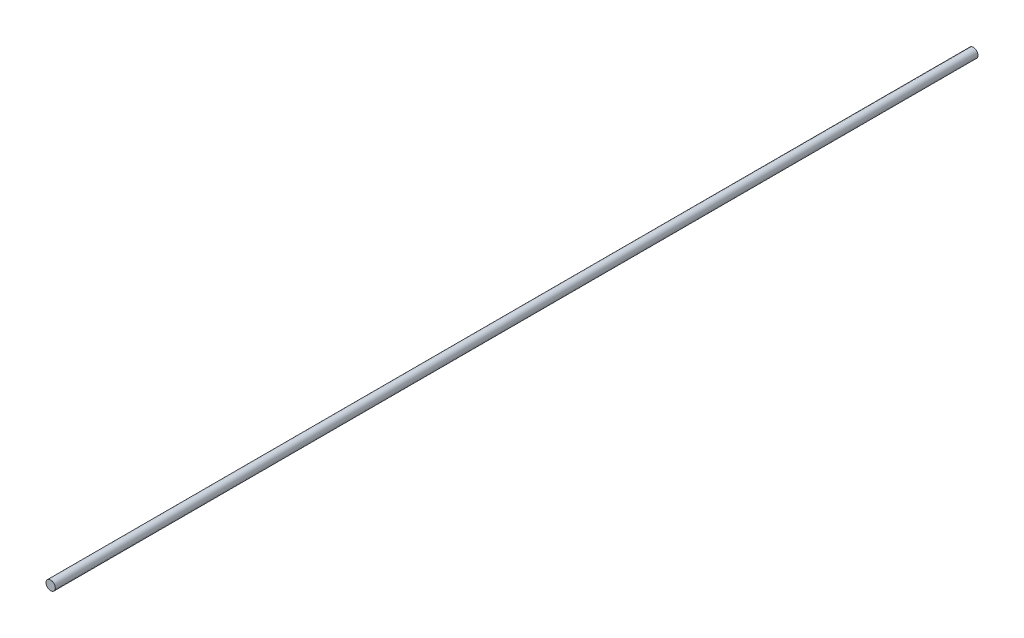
ISO-10303-21;
HEADER;
FILE_DESCRIPTION(('STEP AP214'),'2;1');
FILE_NAME('part.step','',(''),(''),'','','');
FILE_SCHEMA(('AUTOMOTIVE_DESIGN { 1 0 10303 214 1 1 1 1 }'));
ENDSEC;
DATA;
#1=APPLICATION_CONTEXT('core data for automotive mechanical design processes');
#2=APPLICATION_PROTOCOL_DEFINITION('international standard','automotive_design',2000,#1);
#3=PRODUCT_CONTEXT('',#1,'mechanical');
#4=PRODUCT('Part','Part','',(#3));
#5=PRODUCT_RELATED_PRODUCT_CATEGORY('part','',(#4));
#6=PRODUCT_DEFINITION_FORMATION('','',#4);
#7=PRODUCT_DEFINITION_CONTEXT('part definition',#1,'design');
#8=PRODUCT_DEFINITION('design','',#6,#7);
#9=PRODUCT_DEFINITION_SHAPE('','',#8);
#10=(LENGTH_UNIT() NAMED_UNIT(*) SI_UNIT(.MILLI.,.METRE.));
#11=(NAMED_UNIT(*) PLANE_ANGLE_UNIT() SI_UNIT($,.RADIAN.));
#12=(NAMED_UNIT(*) SI_UNIT($,.STERADIAN.) SOLID_ANGLE_UNIT());
#13=UNCERTAINTY_MEASURE_WITH_UNIT(LENGTH_MEASURE(1.E-05),#10,'distance_accuracy_value','');
#14=(GEOMETRIC_REPRESENTATION_CONTEXT(3) GLOBAL_UNCERTAINTY_ASSIGNED_CONTEXT((#13)) GLOBAL_UNIT_ASSIGNED_CONTEXT((#10,
#11,#12)) REPRESENTATION_CONTEXT('',''));
#15=CARTESIAN_POINT('',(0.,0.,0.));
#16=DIRECTION('',(0.,0.,1.));
#17=DIRECTION('',(1.,0.,0.));
#18=AXIS2_PLACEMENT_3D('',#15,#16,#17);
#19=CARTESIAN_POINT('',(0.,0.,-5950.));
#20=DIRECTION('',(0.,0.,1.));
#21=DIRECTION('',(1.,0.,0.));
#22=AXIS2_PLACEMENT_3D('',#19,#20,#21);
#23=CYLINDRICAL_SURFACE('',#22,30.);
#24=CARTESIAN_POINT('',(0.,0.,-5950.));
#25=DIRECTION('',(0.,0.,1.));
#26=DIRECTION('',(1.,0.,0.));
#27=AXIS2_PLACEMENT_3D('',#24,#25,#26);
#28=CIRCLE('',#27,30.);
#29=CARTESIAN_POINT('',(30.,0.,-5950.));
#30=VERTEX_POINT('',#29);
#31=EDGE_CURVE('E10',#30,#30,#28,.T.);
#32=ORIENTED_EDGE('',*,*,#31,.T.);
#33=EDGE_LOOP('',(#32));
#34=FACE_BOUND('',#33,.T.);
#35=CARTESIAN_POINT('',(0.,0.,0.));
#36=DIRECTION('',(0.,0.,1.));
#37=DIRECTION('',(1.,0.,0.));
#38=AXIS2_PLACEMENT_3D('',#35,#36,#37);
#39=CIRCLE('',#38,30.);
#40=CARTESIAN_POINT('',(30.,0.,0.));
#41=VERTEX_POINT('',#40);
#42=EDGE_CURVE('E40',#41,#41,#39,.T.);
#43=ORIENTED_EDGE('',*,*,#42,.F.);
#44=EDGE_LOOP('',(#43));
#45=FACE_BOUND('',#44,.T.);
#46=ADVANCED_FACE('F37',(#34,#45),#23,.T.);
#47=CARTESIAN_POINT('',(0.,0.,-5950.));
#48=DIRECTION('',(0.,0.,1.));
#49=DIRECTION('',(1.,0.,0.));
#50=AXIS2_PLACEMENT_3D('',#47,#48,#49);
#51=PLANE('',#50);
#52=ORIENTED_EDGE('',*,*,#31,.F.);
#53=EDGE_LOOP('',(#52));
#54=FACE_BOUND('',#53,.T.);
#55=ADVANCED_FACE('F54',(#54),#51,.F.);
#56=CARTESIAN_POINT('',(0.,0.,0.));
#57=DIRECTION('',(0.,0.,1.));
#58=DIRECTION('',(1.,0.,0.));
#59=AXIS2_PLACEMENT_3D('',#56,#57,#58);
#60=PLANE('',#59);
#61=ORIENTED_EDGE('',*,*,#42,.T.);
#62=EDGE_LOOP('',(#61));
#63=FACE_BOUND('',#62,.T.);
#64=ADVANCED_FACE('F51',(#63),#60,.T.);
#65=CLOSED_SHELL('',(#46,#55,#64));
#66=MANIFOLD_SOLID_BREP('B2',#65);
#67=ADVANCED_BREP_SHAPE_REPRESENTATION('',(#18,#66),#14);
#68=SHAPE_DEFINITION_REPRESENTATION(#9,#67);
ENDSEC;
END-ISO-10303-21;
